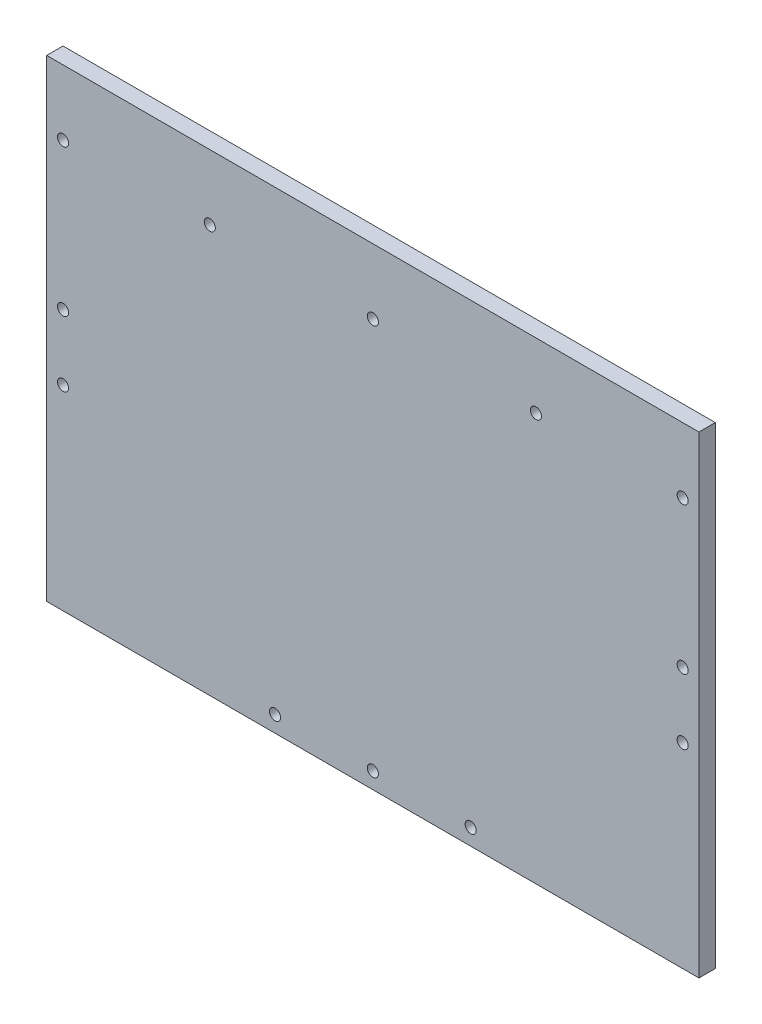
from build123d import *

# Parameters (mm, degrees)
SKETCH_1_W                   = 200
SKETCH_1_H                   = 145
EXTRUDE_1_DEPTH              = 5
HOLE_WIZARD_M3_1_D           = 3.4
HOLE_WIZARD_M3_1_DEPTH       = 14
HOLE_WIZARD_M3_1_CSINK_D     = 6.6
HOLE_WIZARD_M3_1_CSINK_ANGLE = 90
HOLE_WIZARD_M3_1_TIP         = 1.021463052
HOLE_WIZARD_M3_2_D           = 3.4
HOLE_WIZARD_M3_2_DEPTH       = 14
HOLE_WIZARD_M3_2_CSINK_D     = 6.6
HOLE_WIZARD_M3_2_CSINK_ANGLE = 90
HOLE_WIZARD_M3_2_TIP         = 1.021463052
HOLE_WIZARD_M3_3_D           = 3.4
HOLE_WIZARD_M3_3_DEPTH       = 14
HOLE_WIZARD_M3_3_CSINK_D     = 6.6
HOLE_WIZARD_M3_3_CSINK_ANGLE = 90
HOLE_WIZARD_M3_3_TIP         = 1.021463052


with BuildPart() as part:
    # Sketch 1 → Extrude 1 (new body)
    with BuildSketch(Plane.XY):
        Rectangle(SKETCH_1_W, SKETCH_1_H)
    extrude(amount=EXTRUDE_1_DEPTH)

    # Hole Wizard M3 _1
    with Locations(Plane(origin=(0, 0, 0), x_dir=(-1, 0, 0), z_dir=(0, 0, -1))):
        with Locations((-95, 52.5), (-50, 52.5), (50, 52.5), (95, 52.5), (0, 52.5)):
            CounterSinkHole(HOLE_WIZARD_M3_1_D / 2, HOLE_WIZARD_M3_1_CSINK_D / 2, depth=HOLE_WIZARD_M3_1_DEPTH, counter_sink_angle=HOLE_WIZARD_M3_1_CSINK_ANGLE)
            with Locations((0, 0, -(HOLE_WIZARD_M3_1_DEPTH + HOLE_WIZARD_M3_1_TIP / 2))):  # 118° drill point
                Cone(0, HOLE_WIZARD_M3_1_D / 2, HOLE_WIZARD_M3_1_TIP, mode=Mode.SUBTRACT)

    # Hole Wizard M3 _2
    with Locations(Plane(origin=(0, 0, 0), x_dir=(-1, 0, 0), z_dir=(0, 0, -1))):
        with Locations((-95, 7.5), (-95, -12.5), (95, 7.5), (95, -12.5)):
            CounterSinkHole(HOLE_WIZARD_M3_2_D / 2, HOLE_WIZARD_M3_2_CSINK_D / 2, depth=HOLE_WIZARD_M3_2_DEPTH, counter_sink_angle=HOLE_WIZARD_M3_2_CSINK_ANGLE)
            with Locations((0, 0, -(HOLE_WIZARD_M3_2_DEPTH + HOLE_WIZARD_M3_2_TIP / 2))):  # 118° drill point
                Cone(0, HOLE_WIZARD_M3_2_D / 2, HOLE_WIZARD_M3_2_TIP, mode=Mode.SUBTRACT)

    # Hole Wizard M3 _3
    with Locations(Plane(origin=(0, 0, 0), x_dir=(-1, 0, 0), z_dir=(0, 0, -1))):
        with Locations((-30, -67.5), (0, -67.5), (30, -67.5)):
            CounterSinkHole(HOLE_WIZARD_M3_3_D / 2, HOLE_WIZARD_M3_3_CSINK_D / 2, depth=HOLE_WIZARD_M3_3_DEPTH, counter_sink_angle=HOLE_WIZARD_M3_3_CSINK_ANGLE)
            with Locations((0, 0, -(HOLE_WIZARD_M3_3_DEPTH + HOLE_WIZARD_M3_3_TIP / 2))):  # 118° drill point
                Cone(0, HOLE_WIZARD_M3_3_D / 2, HOLE_WIZARD_M3_3_TIP, mode=Mode.SUBTRACT)


solid = part.part
